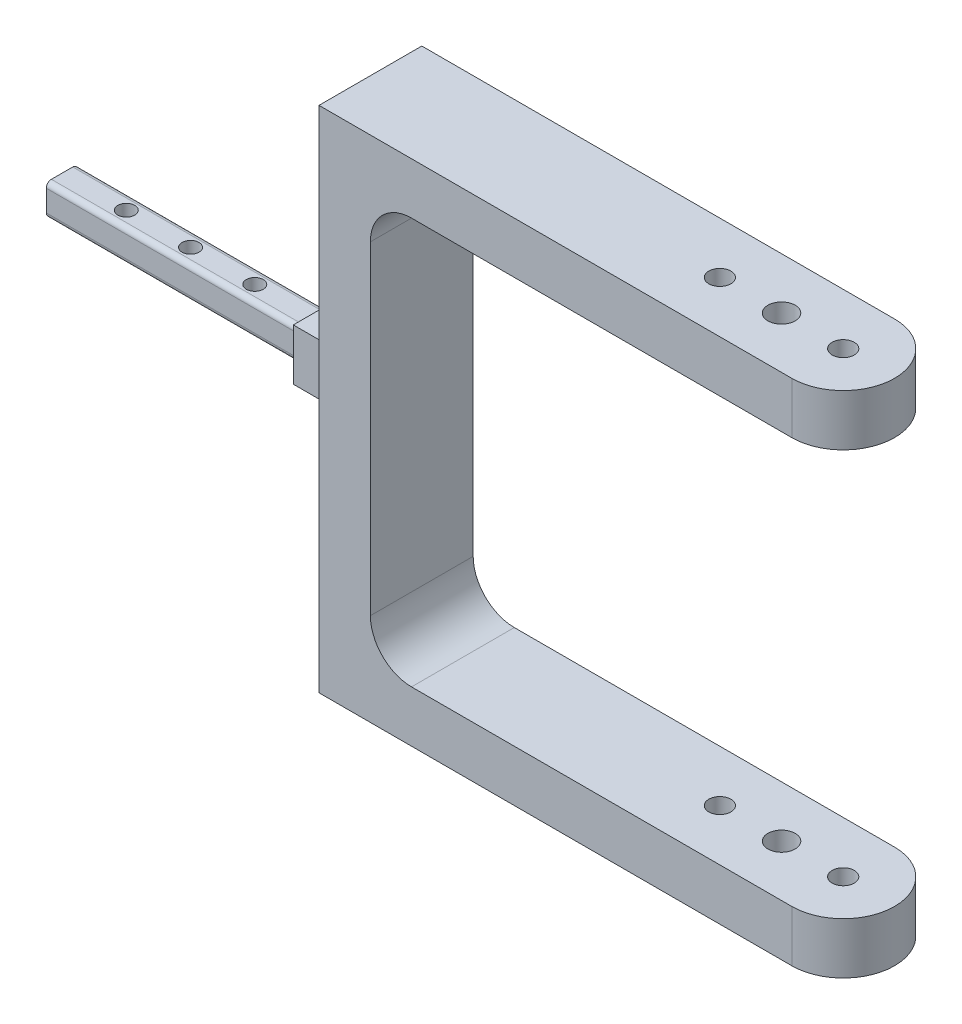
ISO-10303-21;
HEADER;
FILE_DESCRIPTION(('STEP AP214'),'2;1');
FILE_NAME('part.step','',(''),(''),'','','');
FILE_SCHEMA(('AUTOMOTIVE_DESIGN { 1 0 10303 214 1 1 1 1 }'));
ENDSEC;
DATA;
#1=APPLICATION_CONTEXT('core data for automotive mechanical design processes');
#2=APPLICATION_PROTOCOL_DEFINITION('international standard','automotive_design',2000,#1);
#3=PRODUCT_CONTEXT('',#1,'mechanical');
#4=PRODUCT('Part','Part','',(#3));
#5=PRODUCT_RELATED_PRODUCT_CATEGORY('part','',(#4));
#6=PRODUCT_DEFINITION_FORMATION('','',#4);
#7=PRODUCT_DEFINITION_CONTEXT('part definition',#1,'design');
#8=PRODUCT_DEFINITION('design','',#6,#7);
#9=PRODUCT_DEFINITION_SHAPE('','',#8);
#10=(LENGTH_UNIT() NAMED_UNIT(*) SI_UNIT(.MILLI.,.METRE.));
#11=(NAMED_UNIT(*) PLANE_ANGLE_UNIT() SI_UNIT($,.RADIAN.));
#12=(NAMED_UNIT(*) SI_UNIT($,.STERADIAN.) SOLID_ANGLE_UNIT());
#13=UNCERTAINTY_MEASURE_WITH_UNIT(LENGTH_MEASURE(1.E-05),#10,'distance_accuracy_value','');
#14=(GEOMETRIC_REPRESENTATION_CONTEXT(3) GLOBAL_UNCERTAINTY_ASSIGNED_CONTEXT((#13)) GLOBAL_UNIT_ASSIGNED_CONTEXT((#10,
#11,#12)) REPRESENTATION_CONTEXT('',''));
#15=CARTESIAN_POINT('',(0.,0.,0.));
#16=DIRECTION('',(0.,0.,1.));
#17=DIRECTION('',(1.,0.,0.));
#18=AXIS2_PLACEMENT_3D('',#15,#16,#17);
#19=CARTESIAN_POINT('',(80.,49.5,20.));
#20=DIRECTION('',(0.,-1.,0.));
#21=DIRECTION('',(1.,0.,0.));
#22=AXIS2_PLACEMENT_3D('',#19,#20,#21);
#23=PLANE('',#22);
#24=CARTESIAN_POINT('',(82.,49.5,10.));
#25=DIRECTION('',(0.,1.,0.));
#26=DIRECTION('',(-1.,0.,0.));
#27=AXIS2_PLACEMENT_3D('',#24,#25,#26);
#28=CIRCLE('',#27,2.15);
#29=CARTESIAN_POINT('',(79.85,49.5,10.));
#30=VERTEX_POINT('',#29);
#31=EDGE_CURVE('E414',#30,#30,#28,.T.);
#32=ORIENTED_EDGE('',*,*,#31,.F.);
#33=EDGE_LOOP('',(#32));
#34=FACE_BOUND('',#33,.T.);
#35=CARTESIAN_POINT('',(70.,49.5,10.));
#36=DIRECTION('',(0.,1.,0.));
#37=DIRECTION('',(-1.,0.,0.));
#38=AXIS2_PLACEMENT_3D('',#35,#36,#37);
#39=CIRCLE('',#38,2.65);
#40=CARTESIAN_POINT('',(67.35,49.5,10.));
#41=VERTEX_POINT('',#40);
#42=EDGE_CURVE('E421',#41,#41,#39,.T.);
#43=ORIENTED_EDGE('',*,*,#42,.F.);
#44=EDGE_LOOP('',(#43));
#45=FACE_BOUND('',#44,.T.);
#46=CARTESIAN_POINT('',(58.,49.5,10.));
#47=DIRECTION('',(0.,1.,0.));
#48=DIRECTION('',(-1.,0.,0.));
#49=AXIS2_PLACEMENT_3D('',#46,#47,#48);
#50=CIRCLE('',#49,2.15);
#51=CARTESIAN_POINT('',(55.85,49.5,10.));
#52=VERTEX_POINT('',#51);
#53=EDGE_CURVE('E427',#52,#52,#50,.T.);
#54=ORIENTED_EDGE('',*,*,#53,.F.);
#55=EDGE_LOOP('',(#54));
#56=FACE_BOUND('',#55,.T.);
#57=DIRECTION('',(-1.,0.,0.));
#58=VECTOR('',#57,1.);
#59=CARTESIAN_POINT('',(80.,49.5,20.));
#60=LINE('',#59,#58);
#61=CARTESIAN_POINT('',(82.,49.5,20.));
#62=VERTEX_POINT('',#61);
#63=CARTESIAN_POINT('',(-9.99999999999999,49.5,20.));
#64=VERTEX_POINT('',#63);
#65=EDGE_CURVE('E239',#62,#64,#60,.T.);
#66=ORIENTED_EDGE('',*,*,#65,.F.);
#67=CARTESIAN_POINT('',(82.,49.5,10.));
#68=DIRECTION('',(0.,1.,0.));
#69=DIRECTION('',(-1.,0.,0.));
#70=AXIS2_PLACEMENT_3D('',#67,#68,#69);
#71=CIRCLE('',#70,10.);
#72=CARTESIAN_POINT('',(82.,49.5,0.));
#73=VERTEX_POINT('',#72);
#74=EDGE_CURVE('E220',#62,#73,#71,.T.);
#75=ORIENTED_EDGE('',*,*,#74,.T.);
#76=DIRECTION('',(-1.,0.,0.));
#77=VECTOR('',#76,1.);
#78=CARTESIAN_POINT('',(80.,49.5,0.));
#79=LINE('',#78,#77);
#80=CARTESIAN_POINT('',(-9.99999999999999,49.5,0.));
#81=VERTEX_POINT('',#80);
#82=EDGE_CURVE('E247',#73,#81,#79,.T.);
#83=ORIENTED_EDGE('',*,*,#82,.T.);
#84=DIRECTION('',(0.,0.,-1.));
#85=VECTOR('',#84,1.);
#86=CARTESIAN_POINT('',(-9.99999999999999,49.5,20.));
#87=LINE('',#86,#85);
#88=EDGE_CURVE('E262',#64,#81,#87,.T.);
#89=ORIENTED_EDGE('',*,*,#88,.F.);
#90=EDGE_LOOP('',(#66,#75,#83,#89));
#91=FACE_BOUND('',#90,.T.);
#92=ADVANCED_FACE('F61',(#34,#45,#56,#91),#23,.F.);
#93=CARTESIAN_POINT('',(-9.99999999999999,-49.5,20.));
#94=DIRECTION('',(0.,1.,0.));
#95=DIRECTION('',(-1.,0.,0.));
#96=AXIS2_PLACEMENT_3D('',#93,#94,#95);
#97=PLANE('',#96);
#98=CARTESIAN_POINT('',(82.,-49.5,10.));
#99=DIRECTION('',(0.,1.,0.));
#100=DIRECTION('',(-1.,0.,0.));
#101=AXIS2_PLACEMENT_3D('',#98,#99,#100);
#102=CIRCLE('',#101,2.15);
#103=CARTESIAN_POINT('',(79.85,-49.5,10.));
#104=VERTEX_POINT('',#103);
#105=EDGE_CURVE('E417',#104,#104,#102,.T.);
#106=ORIENTED_EDGE('',*,*,#105,.T.);
#107=EDGE_LOOP('',(#106));
#108=FACE_BOUND('',#107,.T.);
#109=CARTESIAN_POINT('',(70.,-49.5,10.));
#110=DIRECTION('',(0.,1.,0.));
#111=DIRECTION('',(-1.,0.,0.));
#112=AXIS2_PLACEMENT_3D('',#109,#110,#111);
#113=CIRCLE('',#112,2.65);
#114=CARTESIAN_POINT('',(67.35,-49.5,10.));
#115=VERTEX_POINT('',#114);
#116=EDGE_CURVE('E424',#115,#115,#113,.T.);
#117=ORIENTED_EDGE('',*,*,#116,.T.);
#118=EDGE_LOOP('',(#117));
#119=FACE_BOUND('',#118,.T.);
#120=CARTESIAN_POINT('',(58.,-49.5,10.));
#121=DIRECTION('',(0.,1.,0.));
#122=DIRECTION('',(-1.,0.,0.));
#123=AXIS2_PLACEMENT_3D('',#120,#121,#122);
#124=CIRCLE('',#123,2.15);
#125=CARTESIAN_POINT('',(55.85,-49.5,10.));
#126=VERTEX_POINT('',#125);
#127=EDGE_CURVE('E413',#126,#126,#124,.T.);
#128=ORIENTED_EDGE('',*,*,#127,.T.);
#129=EDGE_LOOP('',(#128));
#130=FACE_BOUND('',#129,.T.);
#131=CARTESIAN_POINT('',(82.,-49.5,10.));
#132=DIRECTION('',(0.,1.,0.));
#133=DIRECTION('',(-1.,0.,0.));
#134=AXIS2_PLACEMENT_3D('',#131,#132,#133);
#135=CIRCLE('',#134,10.);
#136=CARTESIAN_POINT('',(82.,-49.5,20.));
#137=VERTEX_POINT('',#136);
#138=CARTESIAN_POINT('',(82.,-49.5,0.));
#139=VERTEX_POINT('',#138);
#140=EDGE_CURVE('E209',#137,#139,#135,.T.);
#141=ORIENTED_EDGE('',*,*,#140,.F.);
#142=DIRECTION('',(1.,0.,0.));
#143=VECTOR('',#142,1.);
#144=CARTESIAN_POINT('',(-9.99999999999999,-49.5,20.));
#145=LINE('',#144,#143);
#146=CARTESIAN_POINT('',(-9.99999999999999,-49.5,20.));
#147=VERTEX_POINT('',#146);
#148=EDGE_CURVE('E214',#147,#137,#145,.T.);
#149=ORIENTED_EDGE('',*,*,#148,.F.);
#150=DIRECTION('',(0.,0.,-1.));
#151=VECTOR('',#150,1.);
#152=CARTESIAN_POINT('',(-9.99999999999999,-49.5,20.));
#153=LINE('',#152,#151);
#154=CARTESIAN_POINT('',(-9.99999999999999,-49.5,0.));
#155=VERTEX_POINT('',#154);
#156=EDGE_CURVE('E246',#147,#155,#153,.T.);
#157=ORIENTED_EDGE('',*,*,#156,.T.);
#158=DIRECTION('',(1.,0.,0.));
#159=VECTOR('',#158,1.);
#160=CARTESIAN_POINT('',(-9.99999999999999,-49.5,0.));
#161=LINE('',#160,#159);
#162=EDGE_CURVE('E216',#155,#139,#161,.T.);
#163=ORIENTED_EDGE('',*,*,#162,.T.);
#164=EDGE_LOOP('',(#141,#149,#157,#163));
#165=FACE_BOUND('',#164,.T.);
#166=ADVANCED_FACE('F211',(#108,#119,#130,#165),#97,.F.);
#167=CARTESIAN_POINT('',(80.,-39.4999999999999,20.));
#168=DIRECTION('',(0.,-1.,0.));
#169=DIRECTION('',(1.,0.,0.));
#170=AXIS2_PLACEMENT_3D('',#167,#168,#169);
#171=PLANE('',#170);
#172=CARTESIAN_POINT('',(82.,-39.4999999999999,10.));
#173=DIRECTION('',(0.,-1.,0.));
#174=DIRECTION('',(1.,0.,0.));
#175=AXIS2_PLACEMENT_3D('',#172,#173,#174);
#176=CIRCLE('',#175,2.15);
#177=CARTESIAN_POINT('',(84.15,-39.4999999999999,10.));
#178=VERTEX_POINT('',#177);
#179=EDGE_CURVE('E273',#178,#178,#176,.T.);
#180=ORIENTED_EDGE('',*,*,#179,.T.);
#181=EDGE_LOOP('',(#180));
#182=FACE_BOUND('',#181,.T.);
#183=CARTESIAN_POINT('',(70.,-39.5,10.));
#184=DIRECTION('',(0.,-1.,0.));
#185=DIRECTION('',(1.,0.,0.));
#186=AXIS2_PLACEMENT_3D('',#183,#184,#185);
#187=CIRCLE('',#186,2.65);
#188=CARTESIAN_POINT('',(72.65,-39.5,10.));
#189=VERTEX_POINT('',#188);
#190=EDGE_CURVE('E269',#189,#189,#187,.T.);
#191=ORIENTED_EDGE('',*,*,#190,.T.);
#192=EDGE_LOOP('',(#191));
#193=FACE_BOUND('',#192,.T.);
#194=CARTESIAN_POINT('',(58.,-39.5,10.));
#195=DIRECTION('',(0.,-1.,0.));
#196=DIRECTION('',(1.,0.,0.));
#197=AXIS2_PLACEMENT_3D('',#194,#195,#196);
#198=CIRCLE('',#197,2.15);
#199=CARTESIAN_POINT('',(60.15,-39.5,10.));
#200=VERTEX_POINT('',#199);
#201=EDGE_CURVE('E277',#200,#200,#198,.T.);
#202=ORIENTED_EDGE('',*,*,#201,.T.);
#203=EDGE_LOOP('',(#202));
#204=FACE_BOUND('',#203,.T.);
#205=DIRECTION('',(-1.,0.,0.));
#206=VECTOR('',#205,1.);
#207=CARTESIAN_POINT('',(80.,-39.4999999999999,0.));
#208=LINE('',#207,#206);
#209=CARTESIAN_POINT('',(82.,-39.5,0.));
#210=VERTEX_POINT('',#209);
#211=CARTESIAN_POINT('',(8.00000000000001,-39.5,0.));
#212=VERTEX_POINT('',#211);
#213=EDGE_CURVE('E253',#210,#212,#208,.T.);
#214=ORIENTED_EDGE('',*,*,#213,.T.);
#215=DIRECTION('',(0.,0.,-1.));
#216=VECTOR('',#215,1.);
#217=CARTESIAN_POINT('',(8.00000000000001,-39.5,20.));
#218=LINE('',#217,#216);
#219=CARTESIAN_POINT('',(8.00000000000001,-39.5,20.));
#220=VERTEX_POINT('',#219);
#221=EDGE_CURVE('E321',#212,#220,#218,.F.);
#222=ORIENTED_EDGE('',*,*,#221,.T.);
#223=DIRECTION('',(-1.,0.,0.));
#224=VECTOR('',#223,1.);
#225=CARTESIAN_POINT('',(80.,-39.4999999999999,20.));
#226=LINE('',#225,#224);
#227=CARTESIAN_POINT('',(82.,-39.5,20.));
#228=VERTEX_POINT('',#227);
#229=EDGE_CURVE('E235',#228,#220,#226,.T.);
#230=ORIENTED_EDGE('',*,*,#229,.F.);
#231=CARTESIAN_POINT('',(82.,-39.4999999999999,10.));
#232=DIRECTION('',(0.,-1.,0.));
#233=DIRECTION('',(1.,0.,0.));
#234=AXIS2_PLACEMENT_3D('',#231,#232,#233);
#235=CIRCLE('',#234,10.);
#236=EDGE_CURVE('E226',#210,#228,#235,.T.);
#237=ORIENTED_EDGE('',*,*,#236,.F.);
#238=EDGE_LOOP('',(#214,#222,#230,#237));
#239=FACE_BOUND('',#238,.T.);
#240=ADVANCED_FACE('F519',(#182,#193,#204,#239),#171,.F.);
#241=CARTESIAN_POINT('',(0.,39.5,20.));
#242=DIRECTION('',(0.,1.,0.));
#243=DIRECTION('',(0.,0.,1.));
#244=AXIS2_PLACEMENT_3D('',#241,#242,#243);
#245=PLANE('',#244);
#246=CARTESIAN_POINT('',(82.,39.5,10.));
#247=DIRECTION('',(0.,1.,0.));
#248=DIRECTION('',(0.,0.,1.));
#249=AXIS2_PLACEMENT_3D('',#246,#247,#248);
#250=CIRCLE('',#249,2.15);
#251=CARTESIAN_POINT('',(82.,39.5,12.15));
#252=VERTEX_POINT('',#251);
#253=EDGE_CURVE('E270',#252,#252,#250,.T.);
#254=ORIENTED_EDGE('',*,*,#253,.T.);
#255=EDGE_LOOP('',(#254));
#256=FACE_BOUND('',#255,.T.);
#257=CARTESIAN_POINT('',(70.,39.5,10.));
#258=DIRECTION('',(0.,1.,0.));
#259=DIRECTION('',(0.,0.,1.));
#260=AXIS2_PLACEMENT_3D('',#257,#258,#259);
#261=CIRCLE('',#260,2.65);
#262=CARTESIAN_POINT('',(70.,39.5,12.65));
#263=VERTEX_POINT('',#262);
#264=EDGE_CURVE('E266',#263,#263,#261,.T.);
#265=ORIENTED_EDGE('',*,*,#264,.T.);
#266=EDGE_LOOP('',(#265));
#267=FACE_BOUND('',#266,.T.);
#268=CARTESIAN_POINT('',(58.,39.5,10.));
#269=DIRECTION('',(0.,1.,0.));
#270=DIRECTION('',(0.,0.,1.));
#271=AXIS2_PLACEMENT_3D('',#268,#269,#270);
#272=CIRCLE('',#271,2.15);
#273=CARTESIAN_POINT('',(58.,39.5,12.15));
#274=VERTEX_POINT('',#273);
#275=EDGE_CURVE('E274',#274,#274,#272,.T.);
#276=ORIENTED_EDGE('',*,*,#275,.T.);
#277=EDGE_LOOP('',(#276));
#278=FACE_BOUND('',#277,.T.);
#279=DIRECTION('',(1.,0.,0.));
#280=VECTOR('',#279,1.);
#281=CARTESIAN_POINT('',(0.,39.5,20.));
#282=LINE('',#281,#280);
#283=CARTESIAN_POINT('',(8.,39.5,20.));
#284=VERTEX_POINT('',#283);
#285=CARTESIAN_POINT('',(82.,39.5,20.));
#286=VERTEX_POINT('',#285);
#287=EDGE_CURVE('E244',#284,#286,#282,.T.);
#288=ORIENTED_EDGE('',*,*,#287,.F.);
#289=DIRECTION('',(0.,0.,-1.));
#290=VECTOR('',#289,1.);
#291=CARTESIAN_POINT('',(8.,39.5,0.));
#292=LINE('',#291,#290);
#293=CARTESIAN_POINT('',(8.,39.5,0.));
#294=VERTEX_POINT('',#293);
#295=EDGE_CURVE('E323',#284,#294,#292,.T.);
#296=ORIENTED_EDGE('',*,*,#295,.T.);
#297=DIRECTION('',(1.,0.,0.));
#298=VECTOR('',#297,1.);
#299=CARTESIAN_POINT('',(0.,39.5,0.));
#300=LINE('',#299,#298);
#301=CARTESIAN_POINT('',(82.,39.5,0.));
#302=VERTEX_POINT('',#301);
#303=EDGE_CURVE('E259',#294,#302,#300,.T.);
#304=ORIENTED_EDGE('',*,*,#303,.T.);
#305=CARTESIAN_POINT('',(82.,39.5,10.));
#306=DIRECTION('',(0.,1.,0.));
#307=DIRECTION('',(0.,0.,1.));
#308=AXIS2_PLACEMENT_3D('',#305,#306,#307);
#309=CIRCLE('',#308,10.);
#310=EDGE_CURVE('E341',#286,#302,#309,.T.);
#311=ORIENTED_EDGE('',*,*,#310,.F.);
#312=EDGE_LOOP('',(#288,#296,#304,#311));
#313=FACE_BOUND('',#312,.T.);
#314=ADVANCED_FACE('F338',(#256,#267,#278,#313),#245,.F.);
#315=CARTESIAN_POINT('',(0.,0.,20.));
#316=DIRECTION('',(0.,0.,1.));
#317=DIRECTION('',(1.,0.,0.));
#318=AXIS2_PLACEMENT_3D('',#315,#316,#317);
#319=PLANE('',#318);
#320=ORIENTED_EDGE('',*,*,#148,.T.);
#321=DIRECTION('',(0.,1.,0.));
#322=VECTOR('',#321,1.);
#323=CARTESIAN_POINT('',(82.,-49.5,20.));
#324=LINE('',#323,#322);
#325=EDGE_CURVE('E223',#137,#228,#324,.T.);
#326=ORIENTED_EDGE('',*,*,#325,.T.);
#327=ORIENTED_EDGE('',*,*,#229,.T.);
#328=CARTESIAN_POINT('',(8.,-31.5,20.));
#329=DIRECTION('',(0.,0.,1.));
#330=DIRECTION('',(1.,0.,0.));
#331=AXIS2_PLACEMENT_3D('',#328,#329,#330);
#332=CIRCLE('',#331,8.);
#333=CARTESIAN_POINT('',(0.,-31.5,20.));
#334=VERTEX_POINT('',#333);
#335=EDGE_CURVE('E327',#220,#334,#332,.F.);
#336=ORIENTED_EDGE('',*,*,#335,.T.);
#337=DIRECTION('',(0.,1.,0.));
#338=VECTOR('',#337,1.);
#339=CARTESIAN_POINT('',(0.,39.5,20.));
#340=LINE('',#339,#338);
#341=CARTESIAN_POINT('',(0.,31.5,20.));
#342=VERTEX_POINT('',#341);
#343=EDGE_CURVE('E237',#334,#342,#340,.T.);
#344=ORIENTED_EDGE('',*,*,#343,.T.);
#345=CARTESIAN_POINT('',(8.,31.5,20.));
#346=DIRECTION('',(0.,0.,1.));
#347=DIRECTION('',(1.,0.,0.));
#348=AXIS2_PLACEMENT_3D('',#345,#346,#347);
#349=CIRCLE('',#348,8.);
#350=EDGE_CURVE('E12',#342,#284,#349,.F.);
#351=ORIENTED_EDGE('',*,*,#350,.T.);
#352=ORIENTED_EDGE('',*,*,#287,.T.);
#353=DIRECTION('',(0.,1.,0.));
#354=VECTOR('',#353,1.);
#355=CARTESIAN_POINT('',(82.,-49.5,20.));
#356=LINE('',#355,#354);
#357=EDGE_CURVE('E265',#286,#62,#356,.T.);
#358=ORIENTED_EDGE('',*,*,#357,.T.);
#359=ORIENTED_EDGE('',*,*,#65,.T.);
#360=DIRECTION('',(0.,-1.,0.));
#361=VECTOR('',#360,1.);
#362=CARTESIAN_POINT('',(-9.99999999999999,49.5,20.));
#363=LINE('',#362,#361);
#364=EDGE_CURVE('E233',#64,#147,#363,.T.);
#365=ORIENTED_EDGE('',*,*,#364,.T.);
#366=EDGE_LOOP('',(#320,#326,#327,#336,#344,#351,#352,#358,#359,#365));
#367=FACE_BOUND('',#366,.T.);
#368=ADVANCED_FACE('F231',(#367),#319,.T.);
#369=CARTESIAN_POINT('',(0.,0.,0.));
#370=DIRECTION('',(0.,0.,1.));
#371=DIRECTION('',(1.,0.,0.));
#372=AXIS2_PLACEMENT_3D('',#369,#370,#371);
#373=PLANE('',#372);
#374=DIRECTION('',(0.,1.,0.));
#375=VECTOR('',#374,1.);
#376=CARTESIAN_POINT('',(82.,-49.5,0.));
#377=LINE('',#376,#375);
#378=EDGE_CURVE('E418',#139,#210,#377,.T.);
#379=ORIENTED_EDGE('',*,*,#378,.F.);
#380=ORIENTED_EDGE('',*,*,#162,.F.);
#381=DIRECTION('',(0.,-1.,0.));
#382=VECTOR('',#381,1.);
#383=CARTESIAN_POINT('',(-9.99999999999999,49.5,0.));
#384=LINE('',#383,#382);
#385=EDGE_CURVE('E249',#81,#155,#384,.T.);
#386=ORIENTED_EDGE('',*,*,#385,.F.);
#387=ORIENTED_EDGE('',*,*,#82,.F.);
#388=EDGE_CURVE('E219',#302,#73,#377,.T.);
#389=ORIENTED_EDGE('',*,*,#388,.F.);
#390=ORIENTED_EDGE('',*,*,#303,.F.);
#391=CARTESIAN_POINT('',(8.,31.5,0.));
#392=DIRECTION('',(0.,0.,1.));
#393=DIRECTION('',(1.,0.,0.));
#394=AXIS2_PLACEMENT_3D('',#391,#392,#393);
#395=CIRCLE('',#394,8.);
#396=CARTESIAN_POINT('',(0.,31.5,0.));
#397=VERTEX_POINT('',#396);
#398=EDGE_CURVE('E69',#294,#397,#395,.T.);
#399=ORIENTED_EDGE('',*,*,#398,.T.);
#400=DIRECTION('',(0.,1.,0.));
#401=VECTOR('',#400,1.);
#402=CARTESIAN_POINT('',(0.,39.5,0.));
#403=LINE('',#402,#401);
#404=CARTESIAN_POINT('',(0.,-31.5,0.));
#405=VERTEX_POINT('',#404);
#406=EDGE_CURVE('E256',#405,#397,#403,.T.);
#407=ORIENTED_EDGE('',*,*,#406,.F.);
#408=CARTESIAN_POINT('',(8.,-31.5,0.));
#409=DIRECTION('',(0.,0.,1.));
#410=DIRECTION('',(1.,0.,0.));
#411=AXIS2_PLACEMENT_3D('',#408,#409,#410);
#412=CIRCLE('',#411,8.);
#413=EDGE_CURVE('E325',#405,#212,#412,.T.);
#414=ORIENTED_EDGE('',*,*,#413,.T.);
#415=ORIENTED_EDGE('',*,*,#213,.F.);
#416=EDGE_LOOP('',(#379,#380,#386,#387,#389,#390,#399,#407,#414,#415));
#417=FACE_BOUND('',#416,.T.);
#418=ADVANCED_FACE('F331',(#417),#373,.F.);
#419=CARTESIAN_POINT('',(-20.,0.,0.));
#420=DIRECTION('',(-1.,0.,0.));
#421=DIRECTION('',(0.,-1.,0.));
#422=AXIS2_PLACEMENT_3D('',#419,#420,#421);
#423=PLANE('',#422);
#424=DIRECTION('',(0.,-1.,0.));
#425=VECTOR('',#424,1.);
#426=CARTESIAN_POINT('',(-20.,0.,15.));
#427=LINE('',#426,#425);
#428=CARTESIAN_POINT('',(-20.,5.00000000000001,15.));
#429=VERTEX_POINT('',#428);
#430=CARTESIAN_POINT('',(-20.,-4.99999999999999,15.));
#431=VERTEX_POINT('',#430);
#432=EDGE_CURVE('E365',#429,#431,#427,.T.);
#433=ORIENTED_EDGE('',*,*,#432,.F.);
#434=DIRECTION('',(0.,0.,1.));
#435=VECTOR('',#434,1.);
#436=CARTESIAN_POINT('',(-20.,5.,0.));
#437=LINE('',#436,#435);
#438=CARTESIAN_POINT('',(-20.,5.00000000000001,5.));
#439=VERTEX_POINT('',#438);
#440=EDGE_CURVE('E377',#439,#429,#437,.T.);
#441=ORIENTED_EDGE('',*,*,#440,.F.);
#442=DIRECTION('',(0.,-1.,0.));
#443=VECTOR('',#442,1.);
#444=CARTESIAN_POINT('',(-20.,0.,5.));
#445=LINE('',#444,#443);
#446=CARTESIAN_POINT('',(-20.,-4.99999999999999,5.));
#447=VERTEX_POINT('',#446);
#448=EDGE_CURVE('E375',#439,#447,#445,.T.);
#449=ORIENTED_EDGE('',*,*,#448,.T.);
#450=DIRECTION('',(0.,0.,1.));
#451=VECTOR('',#450,1.);
#452=CARTESIAN_POINT('',(-20.,-4.99999999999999,0.));
#453=LINE('',#452,#451);
#454=EDGE_CURVE('E361',#447,#431,#453,.T.);
#455=ORIENTED_EDGE('',*,*,#454,.T.);
#456=EDGE_LOOP('',(#433,#441,#449,#455));
#457=FACE_BOUND('',#456,.T.);
#458=DIRECTION('',(0.,1.,0.));
#459=VECTOR('',#458,1.);
#460=CARTESIAN_POINT('',(-20.,0.,13.075));
#461=LINE('',#460,#459);
#462=CARTESIAN_POINT('',(-20.,-2.07499999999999,13.075));
#463=VERTEX_POINT('',#462);
#464=CARTESIAN_POINT('',(-20.,2.07500000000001,13.075));
#465=VERTEX_POINT('',#464);
#466=EDGE_CURVE('E382',#463,#465,#461,.T.);
#467=ORIENTED_EDGE('',*,*,#466,.F.);
#468=CARTESIAN_POINT('',(-20.,-2.07499999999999,12.075));
#469=DIRECTION('',(-1.,0.,0.));
#470=DIRECTION('',(0.,-1.,0.));
#471=AXIS2_PLACEMENT_3D('',#468,#469,#470);
#472=CIRCLE('',#471,1.);
#473=CARTESIAN_POINT('',(-20.,-3.07499999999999,12.075));
#474=VERTEX_POINT('',#473);
#475=EDGE_CURVE('E312',#463,#474,#472,.F.);
#476=ORIENTED_EDGE('',*,*,#475,.T.);
#477=DIRECTION('',(0.,0.,-1.));
#478=VECTOR('',#477,1.);
#479=CARTESIAN_POINT('',(-20.,-3.07499999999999,0.));
#480=LINE('',#479,#478);
#481=CARTESIAN_POINT('',(-20.,-3.07499999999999,7.925));
#482=VERTEX_POINT('',#481);
#483=EDGE_CURVE('E392',#474,#482,#480,.T.);
#484=ORIENTED_EDGE('',*,*,#483,.T.);
#485=CARTESIAN_POINT('',(-20.,-2.07499999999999,7.925));
#486=DIRECTION('',(-1.,0.,0.));
#487=DIRECTION('',(0.,-1.,0.));
#488=AXIS2_PLACEMENT_3D('',#485,#486,#487);
#489=CIRCLE('',#488,1.);
#490=CARTESIAN_POINT('',(-20.,-2.07499999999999,6.925));
#491=VERTEX_POINT('',#490);
#492=EDGE_CURVE('E310',#482,#491,#489,.F.);
#493=ORIENTED_EDGE('',*,*,#492,.T.);
#494=DIRECTION('',(0.,1.,0.));
#495=VECTOR('',#494,1.);
#496=CARTESIAN_POINT('',(-20.,0.,6.925));
#497=LINE('',#496,#495);
#498=CARTESIAN_POINT('',(-20.,2.07500000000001,6.925));
#499=VERTEX_POINT('',#498);
#500=EDGE_CURVE('E389',#491,#499,#497,.T.);
#501=ORIENTED_EDGE('',*,*,#500,.T.);
#502=CARTESIAN_POINT('',(-20.,2.07500000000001,7.925));
#503=DIRECTION('',(-1.,0.,0.));
#504=DIRECTION('',(0.,-1.,0.));
#505=AXIS2_PLACEMENT_3D('',#502,#503,#504);
#506=CIRCLE('',#505,1.);
#507=CARTESIAN_POINT('',(-20.,3.07500000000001,7.925));
#508=VERTEX_POINT('',#507);
#509=EDGE_CURVE('E308',#499,#508,#506,.F.);
#510=ORIENTED_EDGE('',*,*,#509,.T.);
#511=DIRECTION('',(0.,0.,-1.));
#512=VECTOR('',#511,1.);
#513=CARTESIAN_POINT('',(-20.,3.07500000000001,0.));
#514=LINE('',#513,#512);
#515=CARTESIAN_POINT('',(-20.,3.07500000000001,12.075));
#516=VERTEX_POINT('',#515);
#517=EDGE_CURVE('E386',#516,#508,#514,.T.);
#518=ORIENTED_EDGE('',*,*,#517,.F.);
#519=CARTESIAN_POINT('',(-20.,2.07500000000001,12.075));
#520=DIRECTION('',(-1.,0.,0.));
#521=DIRECTION('',(0.,-1.,0.));
#522=AXIS2_PLACEMENT_3D('',#519,#520,#521);
#523=CIRCLE('',#522,1.);
#524=EDGE_CURVE('E314',#516,#465,#523,.F.);
#525=ORIENTED_EDGE('',*,*,#524,.T.);
#526=EDGE_LOOP('',(#467,#476,#484,#493,#501,#510,#518,#525));
#527=FACE_BOUND('',#526,.T.);
#528=ADVANCED_FACE('F498',(#457,#527),#423,.T.);
#529=CARTESIAN_POINT('',(-9.99999999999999,49.5,20.));
#530=DIRECTION('',(1.,0.,0.));
#531=DIRECTION('',(0.,1.,0.));
#532=AXIS2_PLACEMENT_3D('',#529,#530,#531);
#533=PLANE('',#532);
#534=DIRECTION('',(0.,0.,1.));
#535=VECTOR('',#534,1.);
#536=CARTESIAN_POINT('',(-9.99999999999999,5.00000000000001,0.));
#537=LINE('',#536,#535);
#538=CARTESIAN_POINT('',(-9.99999999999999,5.,5.));
#539=VERTEX_POINT('',#538);
#540=CARTESIAN_POINT('',(-9.99999999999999,5.,15.));
#541=VERTEX_POINT('',#540);
#542=EDGE_CURVE('E369',#539,#541,#537,.T.);
#543=ORIENTED_EDGE('',*,*,#542,.T.);
#544=DIRECTION('',(0.,-1.,0.));
#545=VECTOR('',#544,1.);
#546=CARTESIAN_POINT('',(-9.99999999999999,0.,15.));
#547=LINE('',#546,#545);
#548=CARTESIAN_POINT('',(-9.99999999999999,-4.99999999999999,15.));
#549=VERTEX_POINT('',#548);
#550=EDGE_CURVE('E371',#541,#549,#547,.T.);
#551=ORIENTED_EDGE('',*,*,#550,.T.);
#552=DIRECTION('',(0.,0.,1.));
#553=VECTOR('',#552,1.);
#554=CARTESIAN_POINT('',(-9.99999999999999,-4.99999999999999,0.));
#555=LINE('',#554,#553);
#556=CARTESIAN_POINT('',(-9.99999999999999,-5.,5.));
#557=VERTEX_POINT('',#556);
#558=EDGE_CURVE('E362',#557,#549,#555,.T.);
#559=ORIENTED_EDGE('',*,*,#558,.F.);
#560=DIRECTION('',(0.,-1.,0.));
#561=VECTOR('',#560,1.);
#562=CARTESIAN_POINT('',(-9.99999999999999,0.,5.));
#563=LINE('',#562,#561);
#564=EDGE_CURVE('E366',#539,#557,#563,.T.);
#565=ORIENTED_EDGE('',*,*,#564,.F.);
#566=EDGE_LOOP('',(#543,#551,#559,#565));
#567=FACE_BOUND('',#566,.T.);
#568=ORIENTED_EDGE('',*,*,#385,.T.);
#569=ORIENTED_EDGE('',*,*,#156,.F.);
#570=ORIENTED_EDGE('',*,*,#364,.F.);
#571=ORIENTED_EDGE('',*,*,#88,.T.);
#572=EDGE_LOOP('',(#568,#569,#570,#571));
#573=FACE_BOUND('',#572,.T.);
#574=ADVANCED_FACE('F500',(#567,#573),#533,.F.);
#575=CARTESIAN_POINT('',(0.,39.5,20.));
#576=DIRECTION('',(-1.,0.,0.));
#577=DIRECTION('',(0.,0.,1.));
#578=AXIS2_PLACEMENT_3D('',#575,#576,#577);
#579=PLANE('',#578);
#580=ORIENTED_EDGE('',*,*,#343,.F.);
#581=DIRECTION('',(0.,0.,-1.));
#582=VECTOR('',#581,1.);
#583=CARTESIAN_POINT('',(0.,-31.5,0.));
#584=LINE('',#583,#582);
#585=EDGE_CURVE('E318',#334,#405,#584,.T.);
#586=ORIENTED_EDGE('',*,*,#585,.T.);
#587=ORIENTED_EDGE('',*,*,#406,.T.);
#588=DIRECTION('',(0.,0.,-1.));
#589=VECTOR('',#588,1.);
#590=CARTESIAN_POINT('',(0.,31.5,20.));
#591=LINE('',#590,#589);
#592=EDGE_CURVE('E316',#397,#342,#591,.F.);
#593=ORIENTED_EDGE('',*,*,#592,.T.);
#594=EDGE_LOOP('',(#580,#586,#587,#593));
#595=FACE_BOUND('',#594,.T.);
#596=ADVANCED_FACE('F335',(#595),#579,.F.);
#597=CARTESIAN_POINT('',(-20.,0.,15.));
#598=DIRECTION('',(0.,0.,1.));
#599=DIRECTION('',(1.,0.,0.));
#600=AXIS2_PLACEMENT_3D('',#597,#598,#599);
#601=PLANE('',#600);
#602=ORIENTED_EDGE('',*,*,#550,.F.);
#603=DIRECTION('',(1.,0.,0.));
#604=VECTOR('',#603,1.);
#605=CARTESIAN_POINT('',(-20.,5.00000000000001,15.));
#606=LINE('',#605,#604);
#607=EDGE_CURVE('E250',#429,#541,#606,.T.);
#608=ORIENTED_EDGE('',*,*,#607,.F.);
#609=ORIENTED_EDGE('',*,*,#432,.T.);
#610=DIRECTION('',(1.,0.,0.));
#611=VECTOR('',#610,1.);
#612=CARTESIAN_POINT('',(-20.,-4.99999999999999,15.));
#613=LINE('',#612,#611);
#614=EDGE_CURVE('E358',#431,#549,#613,.T.);
#615=ORIENTED_EDGE('',*,*,#614,.T.);
#616=EDGE_LOOP('',(#602,#608,#609,#615));
#617=FACE_BOUND('',#616,.T.);
#618=ADVANCED_FACE('F668',(#617),#601,.T.);
#619=CARTESIAN_POINT('',(-20.,5.,0.));
#620=DIRECTION('',(0.,1.,0.));
#621=DIRECTION('',(0.,0.,1.));
#622=AXIS2_PLACEMENT_3D('',#619,#620,#621);
#623=PLANE('',#622);
#624=ORIENTED_EDGE('',*,*,#542,.F.);
#625=DIRECTION('',(1.,0.,0.));
#626=VECTOR('',#625,1.);
#627=CARTESIAN_POINT('',(-20.,5.00000000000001,5.));
#628=LINE('',#627,#626);
#629=EDGE_CURVE('E352',#439,#539,#628,.T.);
#630=ORIENTED_EDGE('',*,*,#629,.F.);
#631=ORIENTED_EDGE('',*,*,#440,.T.);
#632=ORIENTED_EDGE('',*,*,#607,.T.);
#633=EDGE_LOOP('',(#624,#630,#631,#632));
#634=FACE_BOUND('',#633,.T.);
#635=ADVANCED_FACE('F690',(#634),#623,.T.);
#636=CARTESIAN_POINT('',(-20.,0.,5.));
#637=DIRECTION('',(0.,0.,1.));
#638=DIRECTION('',(0.,-1.,0.));
#639=AXIS2_PLACEMENT_3D('',#636,#637,#638);
#640=PLANE('',#639);
#641=ORIENTED_EDGE('',*,*,#564,.T.);
#642=DIRECTION('',(1.,0.,0.));
#643=VECTOR('',#642,1.);
#644=CARTESIAN_POINT('',(-20.,-4.99999999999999,5.));
#645=LINE('',#644,#643);
#646=EDGE_CURVE('E355',#447,#557,#645,.T.);
#647=ORIENTED_EDGE('',*,*,#646,.F.);
#648=ORIENTED_EDGE('',*,*,#448,.F.);
#649=ORIENTED_EDGE('',*,*,#629,.T.);
#650=EDGE_LOOP('',(#641,#647,#648,#649));
#651=FACE_BOUND('',#650,.T.);
#652=ADVANCED_FACE('F577',(#651),#640,.F.);
#653=CARTESIAN_POINT('',(-20.,-4.99999999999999,0.));
#654=DIRECTION('',(0.,1.,0.));
#655=DIRECTION('',(-1.,0.,0.));
#656=AXIS2_PLACEMENT_3D('',#653,#654,#655);
#657=PLANE('',#656);
#658=ORIENTED_EDGE('',*,*,#558,.T.);
#659=ORIENTED_EDGE('',*,*,#614,.F.);
#660=ORIENTED_EDGE('',*,*,#454,.F.);
#661=ORIENTED_EDGE('',*,*,#646,.T.);
#662=EDGE_LOOP('',(#658,#659,#660,#661));
#663=FACE_BOUND('',#662,.T.);
#664=ADVANCED_FACE('F572',(#663),#657,.F.);
#665=CARTESIAN_POINT('',(-70.,-3.075,0.));
#666=DIRECTION('',(0.,-1.,0.));
#667=DIRECTION('',(1.,0.,0.));
#668=AXIS2_PLACEMENT_3D('',#665,#666,#667);
#669=PLANE('',#668);
#670=CARTESIAN_POINT('',(-57.5,-3.07499999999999,10.));
#671=DIRECTION('',(0.,-1.,0.));
#672=DIRECTION('',(1.,0.,0.));
#673=AXIS2_PLACEMENT_3D('',#670,#671,#672);
#674=CIRCLE('',#673,1.65);
#675=CARTESIAN_POINT('',(-55.85,-3.07499999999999,10.));
#676=VERTEX_POINT('',#675);
#677=EDGE_CURVE('E229',#676,#676,#674,.T.);
#678=ORIENTED_EDGE('',*,*,#677,.F.);
#679=EDGE_LOOP('',(#678));
#680=FACE_BOUND('',#679,.T.);
#681=CARTESIAN_POINT('',(-32.5,-3.07499999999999,10.));
#682=DIRECTION('',(0.,-1.,0.));
#683=DIRECTION('',(1.,0.,0.));
#684=AXIS2_PLACEMENT_3D('',#681,#682,#683);
#685=CIRCLE('',#684,1.65);
#686=CARTESIAN_POINT('',(-30.85,-3.07499999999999,10.));
#687=VERTEX_POINT('',#686);
#688=EDGE_CURVE('E436',#687,#687,#685,.T.);
#689=ORIENTED_EDGE('',*,*,#688,.F.);
#690=EDGE_LOOP('',(#689));
#691=FACE_BOUND('',#690,.T.);
#692=CARTESIAN_POINT('',(-45.,-3.07499999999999,10.));
#693=DIRECTION('',(0.,-1.,0.));
#694=DIRECTION('',(1.,0.,0.));
#695=AXIS2_PLACEMENT_3D('',#692,#693,#694);
#696=CIRCLE('',#695,1.65);
#697=CARTESIAN_POINT('',(-43.35,-3.07499999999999,10.));
#698=VERTEX_POINT('',#697);
#699=EDGE_CURVE('E439',#698,#698,#696,.T.);
#700=ORIENTED_EDGE('',*,*,#699,.F.);
#701=EDGE_LOOP('',(#700));
#702=FACE_BOUND('',#701,.T.);
#703=DIRECTION('',(0.,0.,-1.));
#704=VECTOR('',#703,1.);
#705=CARTESIAN_POINT('',(-70.,-3.075,0.));
#706=LINE('',#705,#704);
#707=CARTESIAN_POINT('',(-70.,-3.075,12.075));
#708=VERTEX_POINT('',#707);
#709=CARTESIAN_POINT('',(-70.,-3.075,7.925));
#710=VERTEX_POINT('',#709);
#711=EDGE_CURVE('E385',#708,#710,#706,.T.);
#712=ORIENTED_EDGE('',*,*,#711,.T.);
#713=DIRECTION('',(1.,0.,0.));
#714=VECTOR('',#713,1.);
#715=CARTESIAN_POINT('',(-70.,-3.075,7.925));
#716=LINE('',#715,#714);
#717=EDGE_CURVE('E300',#710,#482,#716,.T.);
#718=ORIENTED_EDGE('',*,*,#717,.T.);
#719=ORIENTED_EDGE('',*,*,#483,.F.);
#720=DIRECTION('',(1.,0.,0.));
#721=VECTOR('',#720,1.);
#722=CARTESIAN_POINT('',(-70.,-3.075,12.075));
#723=LINE('',#722,#721);
#724=EDGE_CURVE('E298',#474,#708,#723,.F.);
#725=ORIENTED_EDGE('',*,*,#724,.T.);
#726=EDGE_LOOP('',(#712,#718,#719,#725));
#727=FACE_BOUND('',#726,.T.);
#728=ADVANCED_FACE('F485',(#680,#691,#702,#727),#669,.T.);
#729=CARTESIAN_POINT('',(-70.,0.,13.075));
#730=DIRECTION('',(0.,0.,-1.));
#731=DIRECTION('',(-1.,0.,0.));
#732=AXIS2_PLACEMENT_3D('',#729,#730,#731);
#733=PLANE('',#732);
#734=DIRECTION('',(0.,1.,0.));
#735=VECTOR('',#734,1.);
#736=CARTESIAN_POINT('',(-70.,0.,13.075));
#737=LINE('',#736,#735);
#738=CARTESIAN_POINT('',(-70.,-2.075,13.075));
#739=VERTEX_POINT('',#738);
#740=CARTESIAN_POINT('',(-70.,2.075,13.075));
#741=VERTEX_POINT('',#740);
#742=EDGE_CURVE('E373',#739,#741,#737,.T.);
#743=ORIENTED_EDGE('',*,*,#742,.F.);
#744=DIRECTION('',(1.,0.,0.));
#745=VECTOR('',#744,1.);
#746=CARTESIAN_POINT('',(-20.,-2.07499999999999,13.075));
#747=LINE('',#746,#745);
#748=EDGE_CURVE('E305',#739,#463,#747,.T.);
#749=ORIENTED_EDGE('',*,*,#748,.T.);
#750=ORIENTED_EDGE('',*,*,#466,.T.);
#751=DIRECTION('',(1.,0.,0.));
#752=VECTOR('',#751,1.);
#753=CARTESIAN_POINT('',(-70.,2.075,13.075));
#754=LINE('',#753,#752);
#755=EDGE_CURVE('E303',#465,#741,#754,.F.);
#756=ORIENTED_EDGE('',*,*,#755,.T.);
#757=EDGE_LOOP('',(#743,#749,#750,#756));
#758=FACE_BOUND('',#757,.T.);
#759=ADVANCED_FACE('F458',(#758),#733,.F.);
#760=CARTESIAN_POINT('',(-70.,3.075,0.));
#761=DIRECTION('',(0.,-1.,0.));
#762=DIRECTION('',(1.,0.,0.));
#763=AXIS2_PLACEMENT_3D('',#760,#761,#762);
#764=PLANE('',#763);
#765=CARTESIAN_POINT('',(-57.5,3.075,10.));
#766=DIRECTION('',(0.,1.,0.));
#767=DIRECTION('',(-1.,0.,0.));
#768=AXIS2_PLACEMENT_3D('',#765,#766,#767);
#769=CIRCLE('',#768,1.65);
#770=CARTESIAN_POINT('',(-59.15,3.075,10.));
#771=VERTEX_POINT('',#770);
#772=EDGE_CURVE('E446',#771,#771,#769,.T.);
#773=ORIENTED_EDGE('',*,*,#772,.F.);
#774=EDGE_LOOP('',(#773));
#775=FACE_BOUND('',#774,.T.);
#776=CARTESIAN_POINT('',(-32.5,3.07500000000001,10.));
#777=DIRECTION('',(0.,1.,0.));
#778=DIRECTION('',(-1.,0.,0.));
#779=AXIS2_PLACEMENT_3D('',#776,#777,#778);
#780=CIRCLE('',#779,1.65);
#781=CARTESIAN_POINT('',(-34.15,3.07500000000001,10.));
#782=VERTEX_POINT('',#781);
#783=EDGE_CURVE('E445',#782,#782,#780,.T.);
#784=ORIENTED_EDGE('',*,*,#783,.F.);
#785=EDGE_LOOP('',(#784));
#786=FACE_BOUND('',#785,.T.);
#787=CARTESIAN_POINT('',(-45.,3.075,10.));
#788=DIRECTION('',(0.,1.,0.));
#789=DIRECTION('',(-1.,0.,0.));
#790=AXIS2_PLACEMENT_3D('',#787,#788,#789);
#791=CIRCLE('',#790,1.65);
#792=CARTESIAN_POINT('',(-46.65,3.075,10.));
#793=VERTEX_POINT('',#792);
#794=EDGE_CURVE('E442',#793,#793,#791,.T.);
#795=ORIENTED_EDGE('',*,*,#794,.F.);
#796=EDGE_LOOP('',(#795));
#797=FACE_BOUND('',#796,.T.);
#798=ORIENTED_EDGE('',*,*,#517,.T.);
#799=DIRECTION('',(1.,0.,0.));
#800=VECTOR('',#799,1.);
#801=CARTESIAN_POINT('',(-70.,3.075,7.925));
#802=LINE('',#801,#800);
#803=CARTESIAN_POINT('',(-70.,3.075,7.925));
#804=VERTEX_POINT('',#803);
#805=EDGE_CURVE('E288',#508,#804,#802,.F.);
#806=ORIENTED_EDGE('',*,*,#805,.T.);
#807=DIRECTION('',(0.,0.,-1.));
#808=VECTOR('',#807,1.);
#809=CARTESIAN_POINT('',(-70.,3.075,0.));
#810=LINE('',#809,#808);
#811=CARTESIAN_POINT('',(-70.,3.075,12.075));
#812=VERTEX_POINT('',#811);
#813=EDGE_CURVE('E397',#812,#804,#810,.T.);
#814=ORIENTED_EDGE('',*,*,#813,.F.);
#815=DIRECTION('',(1.,0.,0.));
#816=VECTOR('',#815,1.);
#817=CARTESIAN_POINT('',(-70.,3.075,12.075));
#818=LINE('',#817,#816);
#819=EDGE_CURVE('E285',#812,#516,#818,.T.);
#820=ORIENTED_EDGE('',*,*,#819,.T.);
#821=EDGE_LOOP('',(#798,#806,#814,#820));
#822=FACE_BOUND('',#821,.T.);
#823=ADVANCED_FACE('F454',(#775,#786,#797,#822),#764,.F.);
#824=CARTESIAN_POINT('',(-70.,0.,6.925));
#825=DIRECTION('',(0.,0.,-1.));
#826=DIRECTION('',(0.,1.,0.));
#827=AXIS2_PLACEMENT_3D('',#824,#825,#826);
#828=PLANE('',#827);
#829=DIRECTION('',(0.,1.,0.));
#830=VECTOR('',#829,1.);
#831=CARTESIAN_POINT('',(-70.,0.,6.925));
#832=LINE('',#831,#830);
#833=CARTESIAN_POINT('',(-70.,-2.075,6.925));
#834=VERTEX_POINT('',#833);
#835=CARTESIAN_POINT('',(-70.,2.075,6.925));
#836=VERTEX_POINT('',#835);
#837=EDGE_CURVE('E400',#834,#836,#832,.T.);
#838=ORIENTED_EDGE('',*,*,#837,.T.);
#839=DIRECTION('',(1.,0.,0.));
#840=VECTOR('',#839,1.);
#841=CARTESIAN_POINT('',(-20.,2.07500000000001,6.925));
#842=LINE('',#841,#840);
#843=EDGE_CURVE('E282',#836,#499,#842,.T.);
#844=ORIENTED_EDGE('',*,*,#843,.T.);
#845=ORIENTED_EDGE('',*,*,#500,.F.);
#846=DIRECTION('',(1.,0.,0.));
#847=VECTOR('',#846,1.);
#848=CARTESIAN_POINT('',(-70.,-2.075,6.925));
#849=LINE('',#848,#847);
#850=EDGE_CURVE('E280',#491,#834,#849,.F.);
#851=ORIENTED_EDGE('',*,*,#850,.T.);
#852=EDGE_LOOP('',(#838,#844,#845,#851));
#853=FACE_BOUND('',#852,.T.);
#854=ADVANCED_FACE('F457',(#853),#828,.T.);
#855=CARTESIAN_POINT('',(-70.,0.,0.));
#856=DIRECTION('',(1.,0.,0.));
#857=DIRECTION('',(0.,1.,0.));
#858=AXIS2_PLACEMENT_3D('',#855,#856,#857);
#859=PLANE('',#858);
#860=ORIENTED_EDGE('',*,*,#813,.T.);
#861=CARTESIAN_POINT('',(-70.,2.075,7.925));
#862=DIRECTION('',(1.,0.,0.));
#863=DIRECTION('',(0.,1.,0.));
#864=AXIS2_PLACEMENT_3D('',#861,#862,#863);
#865=CIRCLE('',#864,1.);
#866=EDGE_CURVE('E296',#804,#836,#865,.F.);
#867=ORIENTED_EDGE('',*,*,#866,.T.);
#868=ORIENTED_EDGE('',*,*,#837,.F.);
#869=CARTESIAN_POINT('',(-70.,-2.075,7.925));
#870=DIRECTION('',(1.,0.,0.));
#871=DIRECTION('',(0.,1.,0.));
#872=AXIS2_PLACEMENT_3D('',#869,#870,#871);
#873=CIRCLE('',#872,1.);
#874=EDGE_CURVE('E294',#834,#710,#873,.F.);
#875=ORIENTED_EDGE('',*,*,#874,.T.);
#876=ORIENTED_EDGE('',*,*,#711,.F.);
#877=CARTESIAN_POINT('',(-70.,-2.075,12.075));
#878=DIRECTION('',(1.,0.,0.));
#879=DIRECTION('',(0.,1.,0.));
#880=AXIS2_PLACEMENT_3D('',#877,#878,#879);
#881=CIRCLE('',#880,1.);
#882=EDGE_CURVE('E292',#708,#739,#881,.F.);
#883=ORIENTED_EDGE('',*,*,#882,.T.);
#884=ORIENTED_EDGE('',*,*,#742,.T.);
#885=CARTESIAN_POINT('',(-70.,2.075,12.075));
#886=DIRECTION('',(1.,0.,0.));
#887=DIRECTION('',(0.,1.,0.));
#888=AXIS2_PLACEMENT_3D('',#885,#886,#887);
#889=CIRCLE('',#888,1.);
#890=EDGE_CURVE('E290',#741,#812,#889,.F.);
#891=ORIENTED_EDGE('',*,*,#890,.T.);
#892=EDGE_LOOP('',(#860,#867,#868,#875,#876,#883,#884,#891));
#893=FACE_BOUND('',#892,.T.);
#894=ADVANCED_FACE('F474',(#893),#859,.F.);
#895=CARTESIAN_POINT('',(82.,-49.5,10.));
#896=DIRECTION('',(0.,1.,0.));
#897=DIRECTION('',(-1.,0.,0.));
#898=AXIS2_PLACEMENT_3D('',#895,#896,#897);
#899=CYLINDRICAL_SURFACE('',#898,10.);
#900=ORIENTED_EDGE('',*,*,#310,.T.);
#901=ORIENTED_EDGE('',*,*,#388,.T.);
#902=ORIENTED_EDGE('',*,*,#74,.F.);
#903=ORIENTED_EDGE('',*,*,#357,.F.);
#904=EDGE_LOOP('',(#900,#901,#902,#903));
#905=FACE_BOUND('',#904,.T.);
#906=ADVANCED_FACE('F545',(#905),#899,.T.);
#907=ORIENTED_EDGE('',*,*,#236,.T.);
#908=ORIENTED_EDGE('',*,*,#325,.F.);
#909=ORIENTED_EDGE('',*,*,#140,.T.);
#910=ORIENTED_EDGE('',*,*,#378,.T.);
#911=EDGE_LOOP('',(#907,#908,#909,#910));
#912=FACE_BOUND('',#911,.T.);
#913=ADVANCED_FACE('F224',(#912),#899,.T.);
#914=CARTESIAN_POINT('',(70.,-49.5,10.));
#915=DIRECTION('',(0.,1.,0.));
#916=DIRECTION('',(-1.,0.,0.));
#917=AXIS2_PLACEMENT_3D('',#914,#915,#916);
#918=CYLINDRICAL_SURFACE('',#917,2.65);
#919=ORIENTED_EDGE('',*,*,#42,.T.);
#920=EDGE_LOOP('',(#919));
#921=FACE_BOUND('',#920,.T.);
#922=ORIENTED_EDGE('',*,*,#264,.F.);
#923=EDGE_LOOP('',(#922));
#924=FACE_BOUND('',#923,.T.);
#925=ADVANCED_FACE('F552',(#921,#924),#918,.F.);
#926=CARTESIAN_POINT('',(82.,-49.5,10.));
#927=DIRECTION('',(0.,1.,0.));
#928=DIRECTION('',(-1.,0.,0.));
#929=AXIS2_PLACEMENT_3D('',#926,#927,#928);
#930=CYLINDRICAL_SURFACE('',#929,2.15);
#931=ORIENTED_EDGE('',*,*,#31,.T.);
#932=EDGE_LOOP('',(#931));
#933=FACE_BOUND('',#932,.T.);
#934=ORIENTED_EDGE('',*,*,#253,.F.);
#935=EDGE_LOOP('',(#934));
#936=FACE_BOUND('',#935,.T.);
#937=ADVANCED_FACE('F566',(#933,#936),#930,.F.);
#938=CARTESIAN_POINT('',(58.,-49.5,10.));
#939=DIRECTION('',(0.,1.,0.));
#940=DIRECTION('',(-1.,0.,0.));
#941=AXIS2_PLACEMENT_3D('',#938,#939,#940);
#942=CYLINDRICAL_SURFACE('',#941,2.15);
#943=ORIENTED_EDGE('',*,*,#53,.T.);
#944=EDGE_LOOP('',(#943));
#945=FACE_BOUND('',#944,.T.);
#946=ORIENTED_EDGE('',*,*,#275,.F.);
#947=EDGE_LOOP('',(#946));
#948=FACE_BOUND('',#947,.T.);
#949=ADVANCED_FACE('F562',(#945,#948),#942,.F.);
#950=ORIENTED_EDGE('',*,*,#116,.F.);
#951=EDGE_LOOP('',(#950));
#952=FACE_BOUND('',#951,.T.);
#953=ORIENTED_EDGE('',*,*,#190,.F.);
#954=EDGE_LOOP('',(#953));
#955=FACE_BOUND('',#954,.T.);
#956=ADVANCED_FACE('F558',(#952,#955),#918,.F.);
#957=ORIENTED_EDGE('',*,*,#105,.F.);
#958=EDGE_LOOP('',(#957));
#959=FACE_BOUND('',#958,.T.);
#960=ORIENTED_EDGE('',*,*,#179,.F.);
#961=EDGE_LOOP('',(#960));
#962=FACE_BOUND('',#961,.T.);
#963=ADVANCED_FACE('F561',(#959,#962),#930,.F.);
#964=ORIENTED_EDGE('',*,*,#127,.F.);
#965=EDGE_LOOP('',(#964));
#966=FACE_BOUND('',#965,.T.);
#967=ORIENTED_EDGE('',*,*,#201,.F.);
#968=EDGE_LOOP('',(#967));
#969=FACE_BOUND('',#968,.T.);
#970=ADVANCED_FACE('F556',(#966,#969),#942,.F.);
#971=CARTESIAN_POINT('',(-45.,-49.5,10.));
#972=DIRECTION('',(0.,1.,0.));
#973=DIRECTION('',(-1.,0.,0.));
#974=AXIS2_PLACEMENT_3D('',#971,#972,#973);
#975=CYLINDRICAL_SURFACE('',#974,1.65);
#976=ORIENTED_EDGE('',*,*,#699,.T.);
#977=EDGE_LOOP('',(#976));
#978=FACE_BOUND('',#977,.T.);
#979=ORIENTED_EDGE('',*,*,#794,.T.);
#980=EDGE_LOOP('',(#979));
#981=FACE_BOUND('',#980,.T.);
#982=ADVANCED_FACE('F585',(#978,#981),#975,.F.);
#983=CARTESIAN_POINT('',(-32.5,-49.5,10.));
#984=DIRECTION('',(0.,1.,0.));
#985=DIRECTION('',(-1.,0.,0.));
#986=AXIS2_PLACEMENT_3D('',#983,#984,#985);
#987=CYLINDRICAL_SURFACE('',#986,1.65);
#988=ORIENTED_EDGE('',*,*,#688,.T.);
#989=EDGE_LOOP('',(#988));
#990=FACE_BOUND('',#989,.T.);
#991=ORIENTED_EDGE('',*,*,#783,.T.);
#992=EDGE_LOOP('',(#991));
#993=FACE_BOUND('',#992,.T.);
#994=ADVANCED_FACE('F452',(#990,#993),#987,.F.);
#995=CARTESIAN_POINT('',(-57.5,-49.5,10.));
#996=DIRECTION('',(0.,1.,0.));
#997=DIRECTION('',(-1.,0.,0.));
#998=AXIS2_PLACEMENT_3D('',#995,#996,#997);
#999=CYLINDRICAL_SURFACE('',#998,1.65);
#1000=ORIENTED_EDGE('',*,*,#677,.T.);
#1001=EDGE_LOOP('',(#1000));
#1002=FACE_BOUND('',#1001,.T.);
#1003=ORIENTED_EDGE('',*,*,#772,.T.);
#1004=EDGE_LOOP('',(#1003));
#1005=FACE_BOUND('',#1004,.T.);
#1006=ADVANCED_FACE('F527',(#1002,#1005),#999,.F.);
#1007=CARTESIAN_POINT('',(-70.,2.075,7.925));
#1008=DIRECTION('',(-1.,0.,0.));
#1009=DIRECTION('',(0.,-1.,0.));
#1010=AXIS2_PLACEMENT_3D('',#1007,#1008,#1009);
#1011=CYLINDRICAL_SURFACE('',#1010,1.);
#1012=ORIENTED_EDGE('',*,*,#866,.F.);
#1013=ORIENTED_EDGE('',*,*,#805,.F.);
#1014=ORIENTED_EDGE('',*,*,#509,.F.);
#1015=ORIENTED_EDGE('',*,*,#843,.F.);
#1016=EDGE_LOOP('',(#1012,#1013,#1014,#1015));
#1017=FACE_BOUND('',#1016,.T.);
#1018=ADVANCED_FACE('F470',(#1017),#1011,.T.);
#1019=CARTESIAN_POINT('',(-70.,-2.075,7.925));
#1020=DIRECTION('',(1.,0.,0.));
#1021=DIRECTION('',(0.,1.,0.));
#1022=AXIS2_PLACEMENT_3D('',#1019,#1020,#1021);
#1023=CYLINDRICAL_SURFACE('',#1022,1.);
#1024=ORIENTED_EDGE('',*,*,#874,.F.);
#1025=ORIENTED_EDGE('',*,*,#850,.F.);
#1026=ORIENTED_EDGE('',*,*,#492,.F.);
#1027=ORIENTED_EDGE('',*,*,#717,.F.);
#1028=EDGE_LOOP('',(#1024,#1025,#1026,#1027));
#1029=FACE_BOUND('',#1028,.T.);
#1030=ADVANCED_FACE('F480',(#1029),#1023,.T.);
#1031=CARTESIAN_POINT('',(-70.,-2.075,12.075));
#1032=DIRECTION('',(-1.,0.,0.));
#1033=DIRECTION('',(0.,-1.,0.));
#1034=AXIS2_PLACEMENT_3D('',#1031,#1032,#1033);
#1035=CYLINDRICAL_SURFACE('',#1034,1.);
#1036=ORIENTED_EDGE('',*,*,#882,.F.);
#1037=ORIENTED_EDGE('',*,*,#724,.F.);
#1038=ORIENTED_EDGE('',*,*,#475,.F.);
#1039=ORIENTED_EDGE('',*,*,#748,.F.);
#1040=EDGE_LOOP('',(#1036,#1037,#1038,#1039));
#1041=FACE_BOUND('',#1040,.T.);
#1042=ADVANCED_FACE('F489',(#1041),#1035,.T.);
#1043=CARTESIAN_POINT('',(-70.,2.075,12.075));
#1044=DIRECTION('',(1.,0.,0.));
#1045=DIRECTION('',(0.,1.,0.));
#1046=AXIS2_PLACEMENT_3D('',#1043,#1044,#1045);
#1047=CYLINDRICAL_SURFACE('',#1046,1.);
#1048=ORIENTED_EDGE('',*,*,#890,.F.);
#1049=ORIENTED_EDGE('',*,*,#755,.F.);
#1050=ORIENTED_EDGE('',*,*,#524,.F.);
#1051=ORIENTED_EDGE('',*,*,#819,.F.);
#1052=EDGE_LOOP('',(#1048,#1049,#1050,#1051));
#1053=FACE_BOUND('',#1052,.T.);
#1054=ADVANCED_FACE('F497',(#1053),#1047,.T.);
#1055=CARTESIAN_POINT('',(8.,-31.5,20.));
#1056=DIRECTION('',(0.,0.,1.));
#1057=DIRECTION('',(1.,0.,0.));
#1058=AXIS2_PLACEMENT_3D('',#1055,#1056,#1057);
#1059=CYLINDRICAL_SURFACE('',#1058,8.);
#1060=ORIENTED_EDGE('',*,*,#335,.F.);
#1061=ORIENTED_EDGE('',*,*,#221,.F.);
#1062=ORIENTED_EDGE('',*,*,#413,.F.);
#1063=ORIENTED_EDGE('',*,*,#585,.F.);
#1064=EDGE_LOOP('',(#1060,#1061,#1062,#1063));
#1065=FACE_BOUND('',#1064,.T.);
#1066=ADVANCED_FACE('F533',(#1065),#1059,.F.);
#1067=CARTESIAN_POINT('',(8.,31.5,20.));
#1068=DIRECTION('',(0.,0.,1.));
#1069=DIRECTION('',(1.,0.,0.));
#1070=AXIS2_PLACEMENT_3D('',#1067,#1068,#1069);
#1071=CYLINDRICAL_SURFACE('',#1070,8.);
#1072=ORIENTED_EDGE('',*,*,#350,.F.);
#1073=ORIENTED_EDGE('',*,*,#592,.F.);
#1074=ORIENTED_EDGE('',*,*,#398,.F.);
#1075=ORIENTED_EDGE('',*,*,#295,.F.);
#1076=EDGE_LOOP('',(#1072,#1073,#1074,#1075));
#1077=FACE_BOUND('',#1076,.T.);
#1078=ADVANCED_FACE('F63',(#1077),#1071,.F.);
#1079=CLOSED_SHELL('',(#92,#166,#240,#314,#368,#418,#528,#574,#596,#618,#635,#652,#664,#728,
#759,#823,#854,#894,#906,#913,#925,#937,#949,#956,#963,#970,#982,#994,#1006,#1018,#1030,#1042,
#1054,#1066,#1078));
#1080=MANIFOLD_SOLID_BREP('B2',#1079);
#1081=ADVANCED_BREP_SHAPE_REPRESENTATION('',(#18,#1080),#14);
#1082=SHAPE_DEFINITION_REPRESENTATION(#9,#1081);
ENDSEC;
END-ISO-10303-21;
